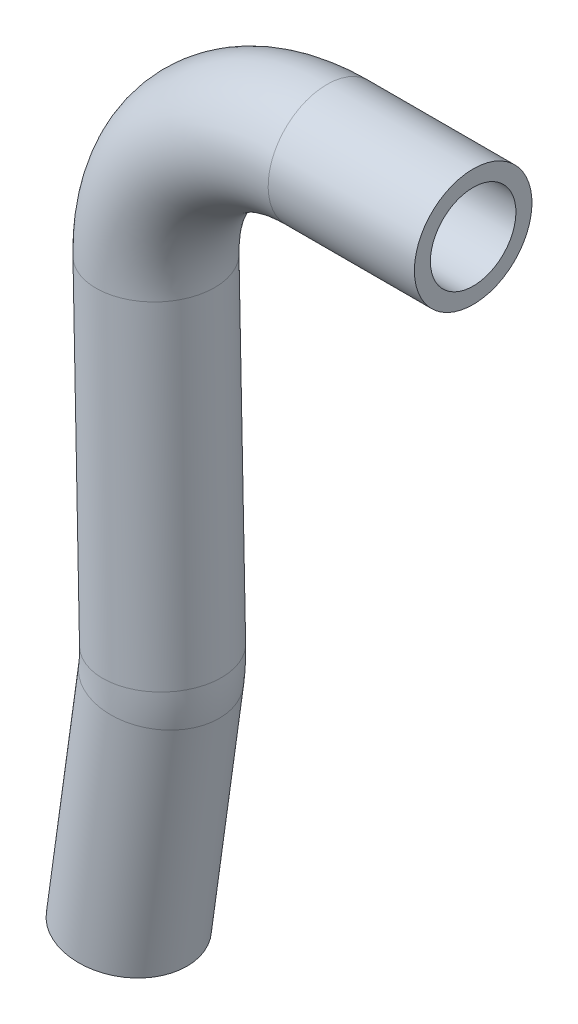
ISO-10303-21;
HEADER;
FILE_DESCRIPTION(('STEP AP214'),'2;1');
FILE_NAME('part.step','',(''),(''),'','','');
FILE_SCHEMA(('AUTOMOTIVE_DESIGN { 1 0 10303 214 1 1 1 1 }'));
ENDSEC;
DATA;
#1=APPLICATION_CONTEXT('core data for automotive mechanical design processes');
#2=APPLICATION_PROTOCOL_DEFINITION('international standard','automotive_design',2000,#1);
#3=PRODUCT_CONTEXT('',#1,'mechanical');
#4=PRODUCT('Part','Part','',(#3));
#5=PRODUCT_RELATED_PRODUCT_CATEGORY('part','',(#4));
#6=PRODUCT_DEFINITION_FORMATION('','',#4);
#7=PRODUCT_DEFINITION_CONTEXT('part definition',#1,'design');
#8=PRODUCT_DEFINITION('design','',#6,#7);
#9=PRODUCT_DEFINITION_SHAPE('','',#8);
#10=(LENGTH_UNIT() NAMED_UNIT(*) SI_UNIT(.MILLI.,.METRE.));
#11=(NAMED_UNIT(*) PLANE_ANGLE_UNIT() SI_UNIT($,.RADIAN.));
#12=(NAMED_UNIT(*) SI_UNIT($,.STERADIAN.) SOLID_ANGLE_UNIT());
#13=UNCERTAINTY_MEASURE_WITH_UNIT(LENGTH_MEASURE(1.E-05),#10,'distance_accuracy_value','');
#14=(GEOMETRIC_REPRESENTATION_CONTEXT(3) GLOBAL_UNCERTAINTY_ASSIGNED_CONTEXT((#13)) GLOBAL_UNIT_ASSIGNED_CONTEXT((#10,
#11,#12)) REPRESENTATION_CONTEXT('',''));
#15=CARTESIAN_POINT('',(0.,0.,0.));
#16=DIRECTION('',(0.,0.,1.));
#17=DIRECTION('',(1.,0.,0.));
#18=AXIS2_PLACEMENT_3D('',#15,#16,#17);
#19=CARTESIAN_POINT('',(-17.6036646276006,-164.983557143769,0.));
#20=DIRECTION('',(-0.138333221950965,-0.990385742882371,0.));
#21=DIRECTION('',(0.990385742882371,-0.138333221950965,0.));
#22=AXIS2_PLACEMENT_3D('',#19,#20,#21);
#23=CYLINDRICAL_SURFACE('',#22,2.75);
#24=CARTESIAN_POINT('',(-17.6036646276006,-164.983557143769,0.));
#25=DIRECTION('',(-0.138333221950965,-0.99038574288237,0.));
#26=DIRECTION('',(0.,0.,1.));
#27=AXIS2_PLACEMENT_3D('',#24,#25,#26);
#28=CIRCLE('',#27,2.75);
#29=CARTESIAN_POINT('',(-14.8801038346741,-165.363973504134,0.));
#30=VERTEX_POINT('',#29);
#31=EDGE_CURVE('E41',#30,#30,#28,.T.);
#32=ORIENTED_EDGE('',*,*,#31,.T.);
#33=EDGE_LOOP('',(#32));
#34=FACE_BOUND('',#33,.T.);
#35=CARTESIAN_POINT('',(-19.112019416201,-175.782503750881,0.));
#36=DIRECTION('',(-0.138333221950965,-0.99038574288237,0.));
#37=DIRECTION('',(0.,0.,1.));
#38=AXIS2_PLACEMENT_3D('',#35,#36,#37);
#39=CIRCLE('',#38,2.75);
#40=CARTESIAN_POINT('',(-19.112019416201,-175.782503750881,2.75));
#41=VERTEX_POINT('',#40);
#42=EDGE_CURVE('E10',#41,#41,#39,.T.);
#43=ORIENTED_EDGE('',*,*,#42,.F.);
#44=EDGE_LOOP('',(#43));
#45=FACE_BOUND('',#44,.T.);
#46=ADVANCED_FACE('F31',(#34,#45),#23,.T.);
#47=CARTESIAN_POINT('',(-17.6036646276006,-164.983557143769,0.));
#48=DIRECTION('',(-0.138333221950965,-0.990385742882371,0.));
#49=DIRECTION('',(0.990385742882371,-0.138333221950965,0.));
#50=AXIS2_PLACEMENT_3D('',#47,#48,#49);
#51=CYLINDRICAL_SURFACE('',#50,2.);
#52=CARTESIAN_POINT('',(-17.6036646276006,-164.983557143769,0.));
#53=DIRECTION('',(-0.138333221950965,-0.99038574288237,0.));
#54=DIRECTION('',(0.,0.,1.));
#55=AXIS2_PLACEMENT_3D('',#52,#53,#54);
#56=CIRCLE('',#55,2.);
#57=CARTESIAN_POINT('',(-15.6228931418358,-165.260223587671,0.));
#58=VERTEX_POINT('',#57);
#59=EDGE_CURVE('E45',#58,#58,#56,.T.);
#60=ORIENTED_EDGE('',*,*,#59,.F.);
#61=EDGE_LOOP('',(#60));
#62=FACE_BOUND('',#61,.T.);
#63=CARTESIAN_POINT('',(-19.112019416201,-175.782503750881,0.));
#64=DIRECTION('',(-0.138333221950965,-0.99038574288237,0.));
#65=DIRECTION('',(0.,0.,1.));
#66=AXIS2_PLACEMENT_3D('',#63,#64,#65);
#67=CIRCLE('',#66,2.);
#68=CARTESIAN_POINT('',(-19.112019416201,-175.782503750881,2.));
#69=VERTEX_POINT('',#68);
#70=EDGE_CURVE('E37',#69,#69,#67,.T.);
#71=ORIENTED_EDGE('',*,*,#70,.T.);
#72=EDGE_LOOP('',(#71));
#73=FACE_BOUND('',#72,.T.);
#74=ADVANCED_FACE('F99',(#62,#73),#51,.F.);
#75=CARTESIAN_POINT('',(-25.5267505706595,-163.876891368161,0.));
#76=DIRECTION('',(0.,0.,-1.));
#77=DIRECTION('',(-1.,0.,0.));
#78=AXIS2_PLACEMENT_3D('',#75,#76,#77);
#79=TOROIDAL_SURFACE('',#78,7.99999999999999,2.75);
#80=CARTESIAN_POINT('',(-17.5283397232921,-163.717442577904,0.));
#81=DIRECTION('',(0.0199310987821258,-0.999801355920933,0.));
#82=DIRECTION('',(0.,0.,1.));
#83=AXIS2_PLACEMENT_3D('',#80,#81,#82);
#84=CIRCLE('',#83,2.75);
#85=CARTESIAN_POINT('',(-14.7788859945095,-163.662632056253,0.));
#86=VERTEX_POINT('',#85);
#87=EDGE_CURVE('E50',#86,#86,#84,.T.);
#88=CARTESIAN_POINT('',(-25.5267505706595,-163.876891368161,0.));
#89=DIRECTION('',(0.,0.,-1.));
#90=DIRECTION('',(-1.,0.,0.));
#91=AXIS2_PLACEMENT_3D('',#88,#89,#90);
#92=CIRCLE('',#91,10.75);
#93=EDGE_CURVE('',#86,#30,#92,.T.);
#94=ORIENTED_EDGE('',*,*,#87,.T.);
#95=ORIENTED_EDGE('',*,*,#31,.F.);
#96=ORIENTED_EDGE('',*,*,#93,.T.);
#97=ORIENTED_EDGE('',*,*,#93,.F.);
#98=EDGE_LOOP('',(#94,#96,#95,#97));
#99=FACE_BOUND('',#98,.T.);
#100=ADVANCED_FACE('F95',(#99),#79,.T.);
#101=CARTESIAN_POINT('',(-25.5267505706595,-163.876891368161,0.));
#102=DIRECTION('',(0.,0.,-1.));
#103=DIRECTION('',(-1.,0.,0.));
#104=AXIS2_PLACEMENT_3D('',#101,#102,#103);
#105=TOROIDAL_SURFACE('',#104,7.99999999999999,2.);
#106=CARTESIAN_POINT('',(-17.5283397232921,-163.717442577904,0.));
#107=DIRECTION('',(0.0199310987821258,-0.999801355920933,0.));
#108=DIRECTION('',(0.,0.,1.));
#109=AXIS2_PLACEMENT_3D('',#106,#107,#108);
#110=CIRCLE('',#109,2.);
#111=CARTESIAN_POINT('',(-15.5287370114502,-163.67758038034,0.));
#112=VERTEX_POINT('',#111);
#113=EDGE_CURVE('E53',#112,#112,#110,.T.);
#114=CARTESIAN_POINT('',(-25.5267505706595,-163.876891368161,0.));
#115=DIRECTION('',(0.,0.,-1.));
#116=DIRECTION('',(-1.,0.,0.));
#117=AXIS2_PLACEMENT_3D('',#114,#115,#116);
#118=CIRCLE('',#117,9.99999999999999);
#119=EDGE_CURVE('',#112,#58,#118,.T.);
#120=ORIENTED_EDGE('',*,*,#113,.F.);
#121=ORIENTED_EDGE('',*,*,#59,.T.);
#122=ORIENTED_EDGE('',*,*,#119,.T.);
#123=ORIENTED_EDGE('',*,*,#119,.F.);
#124=EDGE_LOOP('',(#120,#122,#121,#123));
#125=FACE_BOUND('',#124,.T.);
#126=ADVANCED_FACE('F92',(#125),#105,.F.);
#127=CARTESIAN_POINT('',(-17.840321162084,-148.067554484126,0.));
#128=DIRECTION('',(0.0199310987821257,-0.999801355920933,0.));
#129=DIRECTION('',(0.999801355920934,0.0199310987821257,0.));
#130=AXIS2_PLACEMENT_3D('',#127,#128,#129);
#131=CYLINDRICAL_SURFACE('',#130,2.75);
#132=CARTESIAN_POINT('',(-17.840321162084,-148.067554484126,0.));
#133=DIRECTION('',(0.0199310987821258,-0.999801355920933,0.));
#134=DIRECTION('',(0.,0.,1.));
#135=AXIS2_PLACEMENT_3D('',#132,#133,#134);
#136=CIRCLE('',#135,2.75);
#137=CARTESIAN_POINT('',(-20.5897748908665,-148.122365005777,0.));
#138=VERTEX_POINT('',#137);
#139=EDGE_CURVE('E56',#138,#138,#136,.T.);
#140=ORIENTED_EDGE('',*,*,#139,.T.);
#141=EDGE_LOOP('',(#140));
#142=FACE_BOUND('',#141,.T.);
#143=ORIENTED_EDGE('',*,*,#87,.F.);
#144=EDGE_LOOP('',(#143));
#145=FACE_BOUND('',#144,.T.);
#146=ADVANCED_FACE('F88',(#142,#145),#131,.T.);
#147=CARTESIAN_POINT('',(-17.840321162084,-148.067554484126,0.));
#148=DIRECTION('',(0.0199310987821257,-0.999801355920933,0.));
#149=DIRECTION('',(0.999801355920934,0.0199310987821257,0.));
#150=AXIS2_PLACEMENT_3D('',#147,#148,#149);
#151=CYLINDRICAL_SURFACE('',#150,2.);
#152=CARTESIAN_POINT('',(-17.840321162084,-148.067554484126,0.));
#153=DIRECTION('',(0.0199310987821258,-0.999801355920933,0.));
#154=DIRECTION('',(0.,0.,1.));
#155=AXIS2_PLACEMENT_3D('',#152,#153,#154);
#156=CIRCLE('',#155,2.);
#157=CARTESIAN_POINT('',(-19.8399238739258,-148.10741668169,0.));
#158=VERTEX_POINT('',#157);
#159=EDGE_CURVE('E59',#158,#158,#156,.T.);
#160=ORIENTED_EDGE('',*,*,#159,.F.);
#161=EDGE_LOOP('',(#160));
#162=FACE_BOUND('',#161,.T.);
#163=ORIENTED_EDGE('',*,*,#113,.T.);
#164=EDGE_LOOP('',(#163));
#165=FACE_BOUND('',#164,.T.);
#166=ADVANCED_FACE('F85',(#162,#165),#151,.F.);
#167=CARTESIAN_POINT('',(-9.84191031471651,-147.908105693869,0.));
#168=DIRECTION('',(0.,0.,1.));
#169=DIRECTION('',(1.,0.,0.));
#170=AXIS2_PLACEMENT_3D('',#167,#168,#169);
#171=TOROIDAL_SURFACE('',#170,7.99999999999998,2.75);
#172=CARTESIAN_POINT('',(-9.84191031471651,-139.908105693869,0.));
#173=DIRECTION('',(-1.,0.,0.));
#174=DIRECTION('',(0.,0.,1.));
#175=AXIS2_PLACEMENT_3D('',#172,#173,#174);
#176=CIRCLE('',#175,2.75);
#177=CARTESIAN_POINT('',(-9.84191031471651,-137.158105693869,0.));
#178=VERTEX_POINT('',#177);
#179=EDGE_CURVE('E62',#178,#178,#176,.T.);
#180=CARTESIAN_POINT('',(-9.84191031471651,-147.908105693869,0.));
#181=DIRECTION('',(0.,0.,1.));
#182=DIRECTION('',(1.,0.,0.));
#183=AXIS2_PLACEMENT_3D('',#180,#181,#182);
#184=CIRCLE('',#183,10.75);
#185=EDGE_CURVE('',#178,#138,#184,.T.);
#186=ORIENTED_EDGE('',*,*,#179,.T.);
#187=ORIENTED_EDGE('',*,*,#139,.F.);
#188=ORIENTED_EDGE('',*,*,#185,.T.);
#189=ORIENTED_EDGE('',*,*,#185,.F.);
#190=EDGE_LOOP('',(#186,#188,#187,#189));
#191=FACE_BOUND('',#190,.T.);
#192=ADVANCED_FACE('F81',(#191),#171,.T.);
#193=CARTESIAN_POINT('',(-9.84191031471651,-147.908105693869,0.));
#194=DIRECTION('',(0.,0.,1.));
#195=DIRECTION('',(1.,0.,0.));
#196=AXIS2_PLACEMENT_3D('',#193,#194,#195);
#197=TOROIDAL_SURFACE('',#196,7.99999999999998,2.);
#198=CARTESIAN_POINT('',(-9.84191031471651,-139.908105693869,0.));
#199=DIRECTION('',(-1.,0.,0.));
#200=DIRECTION('',(0.,0.,1.));
#201=AXIS2_PLACEMENT_3D('',#198,#199,#200);
#202=CIRCLE('',#201,2.);
#203=CARTESIAN_POINT('',(-9.84191031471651,-137.908105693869,0.));
#204=VERTEX_POINT('',#203);
#205=EDGE_CURVE('E66',#204,#204,#202,.T.);
#206=CARTESIAN_POINT('',(-9.84191031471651,-147.908105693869,0.));
#207=DIRECTION('',(0.,0.,1.));
#208=DIRECTION('',(1.,0.,0.));
#209=AXIS2_PLACEMENT_3D('',#206,#207,#208);
#210=CIRCLE('',#209,9.99999999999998);
#211=EDGE_CURVE('',#204,#158,#210,.T.);
#212=ORIENTED_EDGE('',*,*,#205,.F.);
#213=ORIENTED_EDGE('',*,*,#159,.T.);
#214=ORIENTED_EDGE('',*,*,#211,.T.);
#215=ORIENTED_EDGE('',*,*,#211,.F.);
#216=EDGE_LOOP('',(#212,#214,#213,#215));
#217=FACE_BOUND('',#216,.T.);
#218=ADVANCED_FACE('F78',(#217),#197,.F.);
#219=CARTESIAN_POINT('',(-9.84191031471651,-139.908105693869,0.));
#220=DIRECTION('',(1.,0.,0.));
#221=DIRECTION('',(0.,1.,0.));
#222=AXIS2_PLACEMENT_3D('',#219,#220,#221);
#223=CYLINDRICAL_SURFACE('',#222,2.);
#224=ORIENTED_EDGE('',*,*,#205,.T.);
#225=EDGE_LOOP('',(#224));
#226=FACE_BOUND('',#225,.T.);
#227=CARTESIAN_POINT('',(-3.,-139.908105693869,0.));
#228=DIRECTION('',(-1.,0.,0.));
#229=DIRECTION('',(0.,0.,1.));
#230=AXIS2_PLACEMENT_3D('',#227,#228,#229);
#231=CIRCLE('',#230,2.);
#232=CARTESIAN_POINT('',(-3.,-139.908105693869,2.));
#233=VERTEX_POINT('',#232);
#234=EDGE_CURVE('E67',#233,#233,#231,.T.);
#235=ORIENTED_EDGE('',*,*,#234,.F.);
#236=EDGE_LOOP('',(#235));
#237=FACE_BOUND('',#236,.T.);
#238=ADVANCED_FACE('F75',(#226,#237),#223,.F.);
#239=CARTESIAN_POINT('',(-9.84191031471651,-139.908105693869,0.));
#240=DIRECTION('',(1.,0.,0.));
#241=DIRECTION('',(0.,1.,0.));
#242=AXIS2_PLACEMENT_3D('',#239,#240,#241);
#243=CYLINDRICAL_SURFACE('',#242,2.75);
#244=ORIENTED_EDGE('',*,*,#179,.F.);
#245=EDGE_LOOP('',(#244));
#246=FACE_BOUND('',#245,.T.);
#247=CARTESIAN_POINT('',(-3.,-139.908105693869,0.));
#248=DIRECTION('',(-1.,0.,0.));
#249=DIRECTION('',(0.,0.,1.));
#250=AXIS2_PLACEMENT_3D('',#247,#248,#249);
#251=CIRCLE('',#250,2.75);
#252=CARTESIAN_POINT('',(-3.,-139.908105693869,2.75));
#253=VERTEX_POINT('',#252);
#254=EDGE_CURVE('E63',#253,#253,#251,.T.);
#255=ORIENTED_EDGE('',*,*,#254,.T.);
#256=EDGE_LOOP('',(#255));
#257=FACE_BOUND('',#256,.T.);
#258=ADVANCED_FACE('F117',(#246,#257),#243,.T.);
#259=CARTESIAN_POINT('',(-19.112019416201,-175.782503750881,0.));
#260=DIRECTION('',(-0.138333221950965,-0.99038574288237,0.));
#261=DIRECTION('',(0.,0.,1.));
#262=AXIS2_PLACEMENT_3D('',#259,#260,#261);
#263=PLANE('',#262);
#264=ORIENTED_EDGE('',*,*,#70,.F.);
#265=EDGE_LOOP('',(#264));
#266=FACE_BOUND('',#265,.T.);
#267=ORIENTED_EDGE('',*,*,#42,.T.);
#268=EDGE_LOOP('',(#267));
#269=FACE_BOUND('',#268,.T.);
#270=ADVANCED_FACE('F120',(#266,#269),#263,.T.);
#271=CARTESIAN_POINT('',(-3.,-139.908105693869,0.));
#272=DIRECTION('',(-1.,0.,0.));
#273=DIRECTION('',(0.,0.,1.));
#274=AXIS2_PLACEMENT_3D('',#271,#272,#273);
#275=PLANE('',#274);
#276=ORIENTED_EDGE('',*,*,#234,.T.);
#277=EDGE_LOOP('',(#276));
#278=FACE_BOUND('',#277,.T.);
#279=ORIENTED_EDGE('',*,*,#254,.F.);
#280=EDGE_LOOP('',(#279));
#281=FACE_BOUND('',#280,.T.);
#282=ADVANCED_FACE('F122',(#278,#281),#275,.F.);
#283=CLOSED_SHELL('',(#46,#74,#100,#126,#146,#166,#192,#218,#238,#258,#270,#282));
#284=MANIFOLD_SOLID_BREP('B2',#283);
#285=ADVANCED_BREP_SHAPE_REPRESENTATION('',(#18,#284),#14);
#286=SHAPE_DEFINITION_REPRESENTATION(#9,#285);
ENDSEC;
END-ISO-10303-21;
